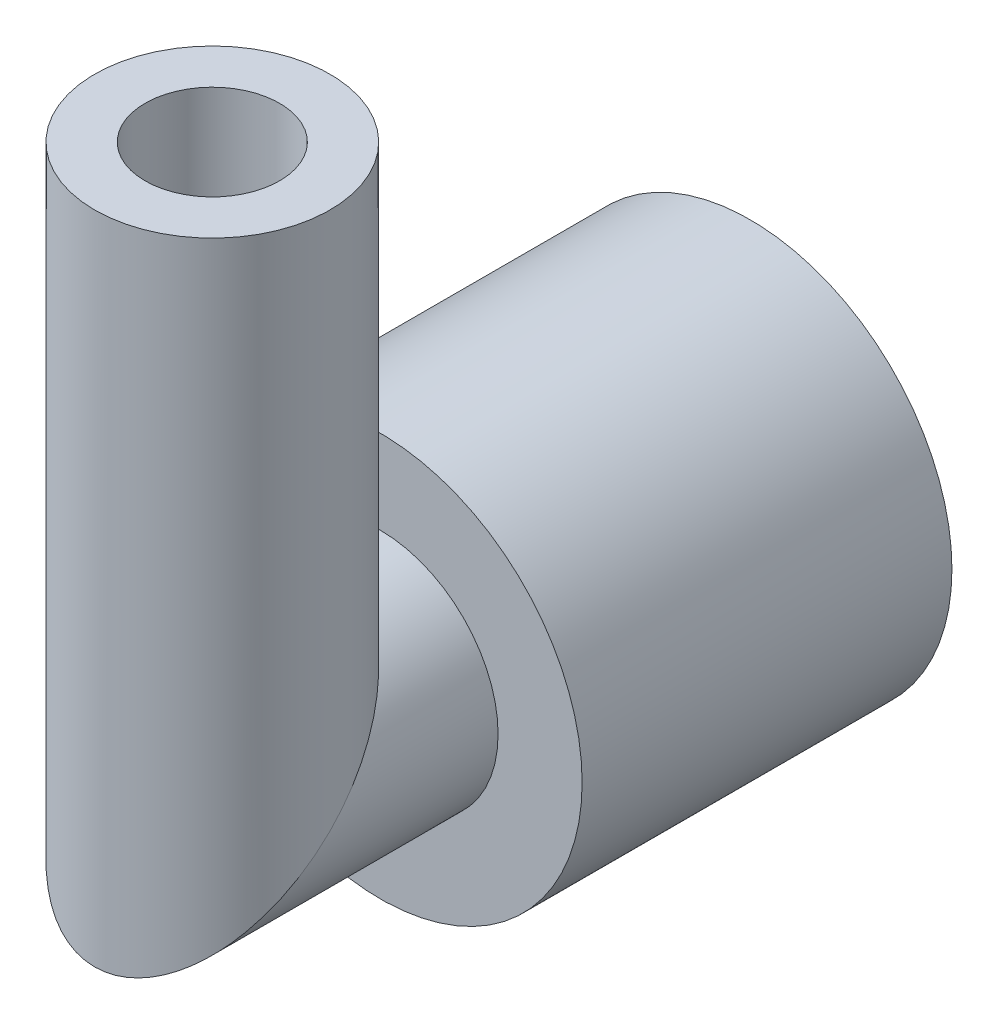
ISO-10303-21;
HEADER;
FILE_DESCRIPTION(('STEP AP214'),'2;1');
FILE_NAME('part.step','',(''),(''),'','','');
FILE_SCHEMA(('AUTOMOTIVE_DESIGN { 1 0 10303 214 1 1 1 1 }'));
ENDSEC;
DATA;
#1=APPLICATION_CONTEXT('core data for automotive mechanical design processes');
#2=APPLICATION_PROTOCOL_DEFINITION('international standard','automotive_design',2000,#1);
#3=PRODUCT_CONTEXT('',#1,'mechanical');
#4=PRODUCT('Part','Part','',(#3));
#5=PRODUCT_RELATED_PRODUCT_CATEGORY('part','',(#4));
#6=PRODUCT_DEFINITION_FORMATION('','',#4);
#7=PRODUCT_DEFINITION_CONTEXT('part definition',#1,'design');
#8=PRODUCT_DEFINITION('design','',#6,#7);
#9=PRODUCT_DEFINITION_SHAPE('','',#8);
#10=(LENGTH_UNIT() NAMED_UNIT(*) SI_UNIT(.MILLI.,.METRE.));
#11=(NAMED_UNIT(*) PLANE_ANGLE_UNIT() SI_UNIT($,.RADIAN.));
#12=(NAMED_UNIT(*) SI_UNIT($,.STERADIAN.) SOLID_ANGLE_UNIT());
#13=UNCERTAINTY_MEASURE_WITH_UNIT(LENGTH_MEASURE(1.E-05),#10,'distance_accuracy_value','');
#14=(GEOMETRIC_REPRESENTATION_CONTEXT(3) GLOBAL_UNCERTAINTY_ASSIGNED_CONTEXT((#13)) GLOBAL_UNIT_ASSIGNED_CONTEXT((#10,
#11,#12)) REPRESENTATION_CONTEXT('',''));
#15=CARTESIAN_POINT('',(0.,0.,0.));
#16=DIRECTION('',(0.,0.,1.));
#17=DIRECTION('',(1.,0.,0.));
#18=AXIS2_PLACEMENT_3D('',#15,#16,#17);
#19=CARTESIAN_POINT('',(0.,-25.4,44.3702241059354));
#20=DIRECTION('',(0.,0.,-1.));
#21=DIRECTION('',(-1.,0.,0.));
#22=AXIS2_PLACEMENT_3D('',#19,#20,#21);
#23=CYLINDRICAL_SURFACE('',#22,3.175);
#24=CARTESIAN_POINT('',(0.,-25.4,25.3999999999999));
#25=DIRECTION('',(0.,0.707106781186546,0.707106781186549));
#26=DIRECTION('',(0.,0.707106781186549,-0.707106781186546));
#27=AXIS2_PLACEMENT_3D('',#24,#25,#26);
#28=ELLIPSE('',#27,4.49012806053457,3.17499999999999);
#29=CARTESIAN_POINT('',(0.,-22.225,22.2249999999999));
#30=VERTEX_POINT('',#29);
#31=EDGE_CURVE('E40',#30,#30,#28,.F.);
#32=ORIENTED_EDGE('',*,*,#31,.F.);
#33=EDGE_LOOP('',(#32));
#34=FACE_BOUND('',#33,.T.);
#35=CARTESIAN_POINT('',(0.,-25.4,15.8749999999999));
#36=DIRECTION('',(0.,0.,-1.));
#37=DIRECTION('',(-1.,0.,0.));
#38=AXIS2_PLACEMENT_3D('',#35,#36,#37);
#39=CIRCLE('',#38,3.175);
#40=CARTESIAN_POINT('',(-3.175,-25.4,15.8749999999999));
#41=VERTEX_POINT('',#40);
#42=EDGE_CURVE('E59',#41,#41,#39,.T.);
#43=ORIENTED_EDGE('',*,*,#42,.T.);
#44=EDGE_LOOP('',(#43));
#45=FACE_BOUND('',#44,.T.);
#46=ADVANCED_FACE('F33',(#34,#45),#23,.F.);
#47=CARTESIAN_POINT('',(0.,-25.4,44.3702241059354));
#48=DIRECTION('',(0.,0.,-1.));
#49=DIRECTION('',(-1.,0.,0.));
#50=AXIS2_PLACEMENT_3D('',#47,#48,#49);
#51=CYLINDRICAL_SURFACE('',#50,5.55625);
#52=CARTESIAN_POINT('',(0.,-25.4,17.4624999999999));
#53=DIRECTION('',(0.,0.,1.));
#54=DIRECTION('',(1.,0.,0.));
#55=AXIS2_PLACEMENT_3D('',#52,#53,#54);
#56=CIRCLE('',#55,5.55625);
#57=CARTESIAN_POINT('',(5.55625,-25.4,17.4624999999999));
#58=VERTEX_POINT('',#57);
#59=EDGE_CURVE('E56',#58,#58,#56,.T.);
#60=ORIENTED_EDGE('',*,*,#59,.T.);
#61=EDGE_LOOP('',(#60));
#62=FACE_BOUND('',#61,.T.);
#63=CARTESIAN_POINT('',(0.,-25.4,25.3999999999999));
#64=DIRECTION('',(0.,0.707106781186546,0.707106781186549));
#65=DIRECTION('',(0.,0.707106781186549,-0.707106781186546));
#66=AXIS2_PLACEMENT_3D('',#63,#64,#65);
#67=ELLIPSE('',#66,7.8577241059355,5.55625);
#68=CARTESIAN_POINT('',(0.,-19.84375,19.8437499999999));
#69=VERTEX_POINT('',#68);
#70=EDGE_CURVE('E10',#69,#69,#67,.T.);
#71=ORIENTED_EDGE('',*,*,#70,.F.);
#72=EDGE_LOOP('',(#71));
#73=FACE_BOUND('',#72,.T.);
#74=ADVANCED_FACE('F35',(#62,#73),#51,.T.);
#75=CARTESIAN_POINT('',(0.,-44.3702241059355,25.3999999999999));
#76=DIRECTION('',(0.,1.,0.));
#77=DIRECTION('',(0.,0.,1.));
#78=AXIS2_PLACEMENT_3D('',#75,#76,#77);
#79=CYLINDRICAL_SURFACE('',#78,5.55624999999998);
#80=ORIENTED_EDGE('',*,*,#70,.T.);
#81=EDGE_LOOP('',(#80));
#82=FACE_BOUND('',#81,.T.);
#83=CARTESIAN_POINT('',(0.,0.,25.3999999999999));
#84=DIRECTION('',(0.,1.,0.));
#85=DIRECTION('',(0.,0.,1.));
#86=AXIS2_PLACEMENT_3D('',#83,#84,#85);
#87=CIRCLE('',#86,5.55624999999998);
#88=CARTESIAN_POINT('',(0.,0.,30.9562499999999));
#89=VERTEX_POINT('',#88);
#90=EDGE_CURVE('E44',#89,#89,#87,.T.);
#91=ORIENTED_EDGE('',*,*,#90,.F.);
#92=EDGE_LOOP('',(#91));
#93=FACE_BOUND('',#92,.T.);
#94=ADVANCED_FACE('F93',(#82,#93),#79,.T.);
#95=CARTESIAN_POINT('',(0.,0.,25.3999999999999));
#96=DIRECTION('',(0.,1.,0.));
#97=DIRECTION('',(0.,0.,1.));
#98=AXIS2_PLACEMENT_3D('',#95,#96,#97);
#99=PLANE('',#98);
#100=CARTESIAN_POINT('',(0.,0.,25.3999999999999));
#101=DIRECTION('',(0.,1.,0.));
#102=DIRECTION('',(0.,0.,1.));
#103=AXIS2_PLACEMENT_3D('',#100,#101,#102);
#104=CIRCLE('',#103,3.17499999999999);
#105=CARTESIAN_POINT('',(0.,0.,28.5749999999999));
#106=VERTEX_POINT('',#105);
#107=EDGE_CURVE('E48',#106,#106,#104,.T.);
#108=ORIENTED_EDGE('',*,*,#107,.F.);
#109=EDGE_LOOP('',(#108));
#110=FACE_BOUND('',#109,.T.);
#111=ORIENTED_EDGE('',*,*,#90,.T.);
#112=EDGE_LOOP('',(#111));
#113=FACE_BOUND('',#112,.T.);
#114=ADVANCED_FACE('F83',(#110,#113),#99,.T.);
#115=CARTESIAN_POINT('',(0.,-44.3702241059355,25.3999999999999));
#116=DIRECTION('',(0.,1.,0.));
#117=DIRECTION('',(0.,0.,1.));
#118=AXIS2_PLACEMENT_3D('',#115,#116,#117);
#119=CYLINDRICAL_SURFACE('',#118,3.17499999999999);
#120=ORIENTED_EDGE('',*,*,#31,.T.);
#121=EDGE_LOOP('',(#120));
#122=FACE_BOUND('',#121,.T.);
#123=ORIENTED_EDGE('',*,*,#107,.T.);
#124=EDGE_LOOP('',(#123));
#125=FACE_BOUND('',#124,.T.);
#126=ADVANCED_FACE('F71',(#122,#125),#119,.F.);
#127=CARTESIAN_POINT('',(0.,-25.4,30.9562499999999));
#128=DIRECTION('',(0.,0.,1.));
#129=DIRECTION('',(1.,0.,0.));
#130=AXIS2_PLACEMENT_3D('',#127,#128,#129);
#131=CYLINDRICAL_SURFACE('',#130,9.525);
#132=CARTESIAN_POINT('',(0.,-25.4,17.4624999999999));
#133=DIRECTION('',(0.,0.,1.));
#134=DIRECTION('',(1.,0.,0.));
#135=AXIS2_PLACEMENT_3D('',#132,#133,#134);
#136=CIRCLE('',#135,9.52499999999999);
#137=CARTESIAN_POINT('',(9.52499999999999,-25.4,17.4624999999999));
#138=VERTEX_POINT('',#137);
#139=EDGE_CURVE('E53',#138,#138,#136,.T.);
#140=ORIENTED_EDGE('',*,*,#139,.F.);
#141=EDGE_LOOP('',(#140));
#142=FACE_BOUND('',#141,.T.);
#143=CARTESIAN_POINT('',(0.,-25.4,0.));
#144=DIRECTION('',(0.,0.,-1.));
#145=DIRECTION('',(-1.,0.,0.));
#146=AXIS2_PLACEMENT_3D('',#143,#144,#145);
#147=CIRCLE('',#146,9.525);
#148=CARTESIAN_POINT('',(-9.525,-25.4,0.));
#149=VERTEX_POINT('',#148);
#150=EDGE_CURVE('E62',#149,#149,#147,.T.);
#151=ORIENTED_EDGE('',*,*,#150,.F.);
#152=EDGE_LOOP('',(#151));
#153=FACE_BOUND('',#152,.T.);
#154=ADVANCED_FACE('F68',(#142,#153),#131,.T.);
#155=CARTESIAN_POINT('',(0.,-30.95625,17.4624999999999));
#156=DIRECTION('',(0.,0.,1.));
#157=DIRECTION('',(1.,0.,0.));
#158=AXIS2_PLACEMENT_3D('',#155,#156,#157);
#159=PLANE('',#158);
#160=ORIENTED_EDGE('',*,*,#139,.T.);
#161=EDGE_LOOP('',(#160));
#162=FACE_BOUND('',#161,.T.);
#163=ORIENTED_EDGE('',*,*,#59,.F.);
#164=EDGE_LOOP('',(#163));
#165=FACE_BOUND('',#164,.T.);
#166=ADVANCED_FACE('F70',(#162,#165),#159,.T.);
#167=CARTESIAN_POINT('',(0.,-25.4,15.8749999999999));
#168=DIRECTION('',(0.,0.,-1.));
#169=DIRECTION('',(-1.,0.,0.));
#170=AXIS2_PLACEMENT_3D('',#167,#168,#169);
#171=PLANE('',#170);
#172=ORIENTED_EDGE('',*,*,#42,.F.);
#173=EDGE_LOOP('',(#172));
#174=FACE_BOUND('',#173,.T.);
#175=ADVANCED_FACE('F79',(#174),#171,.F.);
#176=CARTESIAN_POINT('',(0.,-25.4,0.));
#177=DIRECTION('',(0.,0.,1.));
#178=DIRECTION('',(1.,0.,0.));
#179=AXIS2_PLACEMENT_3D('',#176,#177,#178);
#180=PLANE('',#179);
#181=ORIENTED_EDGE('',*,*,#150,.T.);
#182=EDGE_LOOP('',(#181));
#183=FACE_BOUND('',#182,.T.);
#184=ADVANCED_FACE('F66',(#183),#180,.F.);
#185=CLOSED_SHELL('',(#46,#74,#94,#114,#126,#154,#166,#175,#184));
#186=MANIFOLD_SOLID_BREP('B2',#185);
#187=ADVANCED_BREP_SHAPE_REPRESENTATION('',(#18,#186),#14);
#188=SHAPE_DEFINITION_REPRESENTATION(#9,#187);
ENDSEC;
END-ISO-10303-21;
